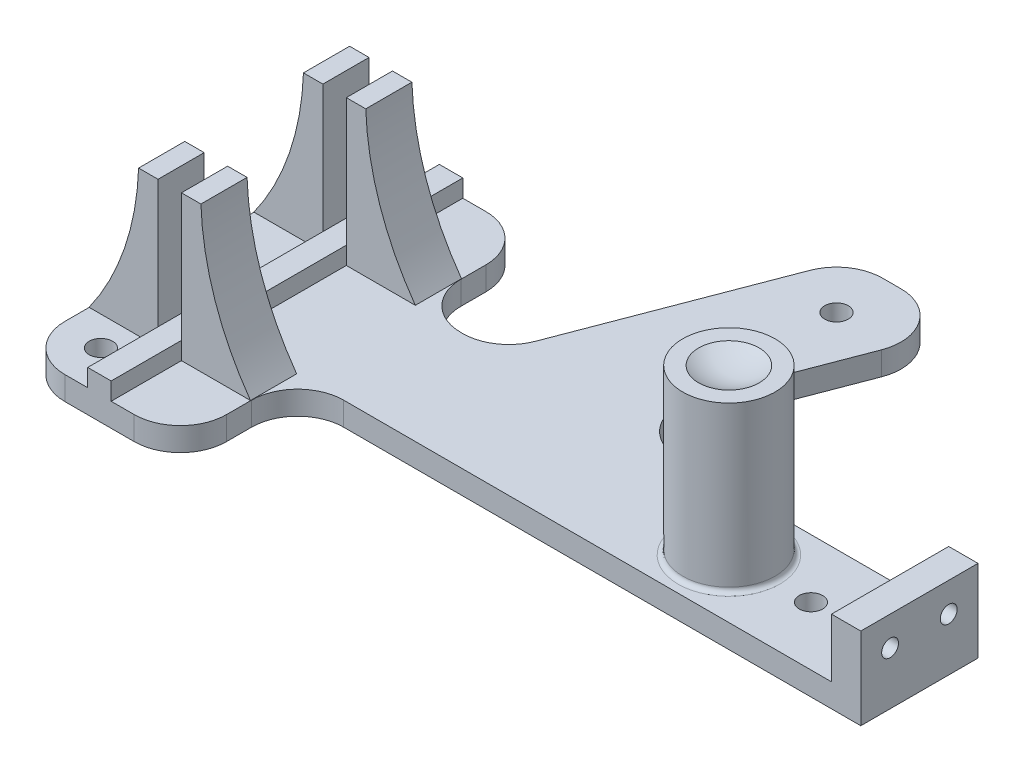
from build123d import *

# Parameters (mm, degrees)
BOSS_EXTRUDE1_DEPTH       = 5.08
BOSS_EXTRUDE2_DEPTH       = 10
SKETCH3_R                 = 10
BOSS_EXTRUDE3_DEPTH       = 35.56
FILLET1_R                 = 1
BOSS_EXTRUDE5_DEPTH       = 5.08
FILLET2_R                 = 10
FILLET3_R                 = 10
SKETCH9_W                 = 6.35
SKETCH9_H                 = 25.4
BOSS_EXTRUDE6_DEPTH       = 12.7
F_6_CLEARANCE_HOLE1_D     = 3.6576
F_6_CLEARANCE_HOLE1_DEPTH = 6.35
CUT_EXTRUDE1_REACH        = 156.709
SKETCH17_R                = 2.54
SKETCH18_W                = 9.525
SKETCH18_H                = 25.4
BOSS_EXTRUDE7_DEPTH       = 17.78
F_6_CLEARANCE_HOLE2_D     = 3.6576
F_6_CLEARANCE_HOLE2_DEPTH = 9.525
SKETCH21_W                = 9.525
SKETCH21_H                = 25.4
CUT_EXTRUDE2_DEPTH        = 12.7
SKETCH22_W                = 5.08
SKETCH22_H                = 76.2
BOSS_EXTRUDE8_DEPTH       = 3.81


with BuildPart() as part:
    # Sketch1 → Boss-Extrude1 (new body)
    with BuildSketch(Plane(origin=(0, 0, 0), x_dir=(1, 0, 0), z_dir=(0, 1, 0))):
        with BuildLine():
            Line((20.08, 28.1), (20.08, 22.7))
            ThreePointArc((20.08, 22.7), (23.008932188, 15.628932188), (30.08, 12.7))
            Line((30.08, 12.7), (126.24, 12.7))
            Line((126.24, 12.7), (132.59, 12.7))
            Line((132.59, 12.7), (132.59, 0))
            Line((132.59, 0), (132.59, -12.7))
            Line((132.59, -12.7), (126.24, -12.7))
            Line((126.24, -12.7), (30.08, -12.7))
            ThreePointArc((30.08, -12.7), (23.008932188, -15.628932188), (20.08, -22.7))
            Line((20.08, -22.7), (20.08, -28.1))
            ThreePointArc((20.08, -28.1), (17.151067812, -35.171067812), (10.08, -38.1))
            Line((10.08, -38.1), (-4.92, -38.1))
            ThreePointArc((-4.92, -38.1), (-11.991067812, -35.171067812), (-14.92, -28.1))
            Line((-14.92, -28.1), (-14.92, 28.1))
            ThreePointArc((-14.92, 28.1), (-11.991067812, 35.171067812), (-4.92, 38.1))
            Line((-4.92, 38.1), (10.08, 38.1))
            ThreePointArc((10.08, 38.1), (17.151067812, 35.171067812), (20.08, 28.1))
        make_face()
    extrude(amount=-BOSS_EXTRUDE1_DEPTH)

    # Sketch2 → Boss-Extrude2 (add)
    with BuildSketch(Plane.XY.offset(22.86)):
        with BuildLine():
            Line((0, 0), (-14.953299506, 0))
            ThreePointArc((-14.953299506, 0), (-7.255141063, 14.95657571), (-4.209502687, 31.5))
            Line((-4.209502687, 31.5), (0, 31.5))
            Line((0, 31.5), (0, 0))
        make_face()
        with BuildLine():
            Line((5.08, 0), (20.033299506, 0))
            ThreePointArc((20.033299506, 0), (12.335141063, 14.95657571), (9.289502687, 31.5))
            Line((9.289502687, 31.5), (5.08, 31.5))
            Line((5.08, 31.5), (5.08, 0))
        make_face()
    boss_extrude2 = extrude(amount=-BOSS_EXTRUDE2_DEPTH)

    # Mirror1: Boss-Extrude2 across plane
    add(boss_extrude2.mirror(Plane.XY))

    # Sketch3 → Boss-Extrude3 (add)
    with BuildSketch(Plane(origin=(0, 0, 0), x_dir=(1, 0, 0), z_dir=(0, 1, 0))):
        with Locations(Location((100.84, 0, 0), (0, 0, 90))):
            Circle(SKETCH3_R)
    extrude(amount=BOSS_EXTRUDE3_DEPTH)

    # Fillet1
    fillet1_edges = [part.edges().sort_by_distance(p)[0] for p in [
        (100.84, 0, 10),
    ]]
    fillet(fillet1_edges, radius=FILLET1_R)

    # Sketch4 → Cut-Revolve1 (revolve, cut)
    with BuildSketch(Plane.XY, mode=Mode.PRIVATE) as cut_revolve1_sk:
        with BuildLine():
            Line((100.84, 35.56), (107.399510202, 35.56))
            ThreePointArc((107.399510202, 35.56), (104.235709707, 34.2471456), (100.84, 33.797283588))
            Line((100.84, 33.797283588), (100.84, 35.56))
        make_face()
    revolve(cut_revolve1_sk.sketch.rotate(Axis((100.84, 35.56, 0), (0, -1, 0)), 90), axis=Axis((100.84, 35.56, 0), (0, -1, 0)), mode=Mode.SUBTRACT)

    # Sketch8 → Boss-Extrude5 (add)
    with BuildSketch(Plane(origin=(0, 0, 0), x_dir=(1, 0, 0), z_dir=(0, 1, 0))):
        with BuildLine():
            Line((37.34, 12.7), (56.207184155, 62.145063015))
            ThreePointArc((56.207184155, 62.145063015), (59.87783999, 66.815612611), (65.550113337, 68.58))
            Line((65.550113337, 68.58), (69.543550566, 68.58))
            ThreePointArc((69.543550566, 68.58), (77.779163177, 64.252273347), (78.886479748, 55.014936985))
            Line((78.886479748, 55.014936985), (62.74, 12.7))
            Line((62.74, 12.7), (37.34, 12.7))
        make_face()
    extrude(amount=-BOSS_EXTRUDE5_DEPTH)

    # Fillet2
    fillet2_edges = [part.edges().sort_by_distance(p)[0] for p in [
        (37.34, -2.54, -12.7),
    ]]
    fillet(fillet2_edges, radius=FILLET2_R)

    # Fillet3
    fillet3_edges = [part.edges().sort_by_distance(p)[0] for p in [
        (62.74, -2.54, -12.7),
    ]]
    fillet(fillet3_edges, radius=FILLET3_R)

    # Sketch9 → Boss-Extrude6 (add)
    with BuildSketch(Plane(origin=(0, 0, 0), x_dir=(1, 0, 0), z_dir=(0, 1, 0))):
        with Locations((129.415, 0)):
            Rectangle(SKETCH9_W, SKETCH9_H)
    extrude(amount=BOSS_EXTRUDE6_DEPTH)

    # 6 Clearance Hole1
    with Locations(Plane(origin=(132.59, 0, 0), x_dir=(0, 0, -1), z_dir=(1, 0, 0))):
        with Locations((6.35, 6.35), (-6.35, 6.35)):
            Hole(F_6_CLEARANCE_HOLE1_D / 2, depth=F_6_CLEARANCE_HOLE1_DEPTH)

    # Sketch17 → Cut-Extrude1 (cut, up to next)
    with BuildSketch(Plane.XZ.offset(5.08), mode=Mode.PRIVATE) as cut_extrude1_sk1:
        with Locations(Location((-6.03, 29.21, 0), (0, 0, 270))):
            Circle(SKETCH17_R)
    cut_extrude1_tool1 = extrude(cut_extrude1_sk1.sketch, amount=-CUT_EXTRUDE1_REACH, mode=Mode.PRIVATE) & part.part
    # Sketch17 → Cut-Extrude1 (cut, up to next)
    with BuildSketch(Plane.XZ.offset(5.08), mode=Mode.PRIVATE) as cut_extrude1_sk2:
        with Locations(Location((-6.03, -29.21, 0), (0, 0, 90))):
            Circle(SKETCH17_R)
    cut_extrude1_tool2 = extrude(cut_extrude1_sk2.sketch, amount=-CUT_EXTRUDE1_REACH, mode=Mode.PRIVATE) & part.part
    # Sketch17 → Cut-Extrude1 (cut, up to next)
    with BuildSketch(Plane.XZ.offset(5.08), mode=Mode.PRIVATE) as cut_extrude1_sk3:
        with Locations(Location((67.001174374, -57.15, 0), (0, 0, 270))):
            Circle(SKETCH17_R)
    cut_extrude1_tool3 = extrude(cut_extrude1_sk3.sketch, amount=-CUT_EXTRUDE1_REACH, mode=Mode.PRIVATE) & part.part
    # Sketch17 → Cut-Extrude1 (cut, up to next)
    with BuildSketch(Plane.XZ.offset(5.08), mode=Mode.PRIVATE) as cut_extrude1_sk4:
        with Locations(Location((118.62, 0, 0), (0, 0, 270))):
            Circle(SKETCH17_R)
    cut_extrude1_tool4 = extrude(cut_extrude1_sk4.sketch, amount=-CUT_EXTRUDE1_REACH, mode=Mode.PRIVATE) & part.part
    add(cut_extrude1_tool1.solids().sort_by_distance((-6.03, -5.08, 29.21))[0], mode=Mode.SUBTRACT)
    add(cut_extrude1_tool2.solids().sort_by_distance((-6.03, -5.08, -29.21))[0], mode=Mode.SUBTRACT)
    add(cut_extrude1_tool3.solids().sort_by_distance((67.001174, -5.08, -57.15))[0], mode=Mode.SUBTRACT)
    add(cut_extrude1_tool4.solids().sort_by_distance((118.62, -5.08, 0))[0], mode=Mode.SUBTRACT)

    # Sketch18 → Boss-Extrude7 (add)
    with BuildSketch(Plane(origin=(0, 12.7, 0), x_dir=(1, 0, 0), z_dir=(0, 1, 0))):
        with Locations((137.3525, 0)):
            Rectangle(SKETCH18_W, SKETCH18_H)
    extrude(amount=-BOSS_EXTRUDE7_DEPTH)

    # 6 Clearance Hole2
    with Locations(Plane.ZY.offset(-132.59)):
        with Locations((6.35, 6.35), (-6.35, 6.35)):
            Hole(F_6_CLEARANCE_HOLE2_D / 2, depth=F_6_CLEARANCE_HOLE2_DEPTH)

    # Sketch21 → Cut-Extrude2 (cut)
    with BuildSketch(Plane(origin=(0, 12.7, 0), x_dir=(1, 0, 0), z_dir=(0, 1, 0))):
        with Locations((131.0025, 0)):
            Rectangle(SKETCH21_W, SKETCH21_H)
    extrude(amount=-CUT_EXTRUDE2_DEPTH, mode=Mode.SUBTRACT)

    # Sketch22 → Boss-Extrude8 (add)
    with BuildSketch(Plane(origin=(0, 0, 0), x_dir=(1, 0, 0), z_dir=(0, 1, 0))):
        with Locations((2.54, 0)):
            Rectangle(SKETCH22_W, SKETCH22_H)
    extrude(amount=BOSS_EXTRUDE8_DEPTH)


solid = part.part
